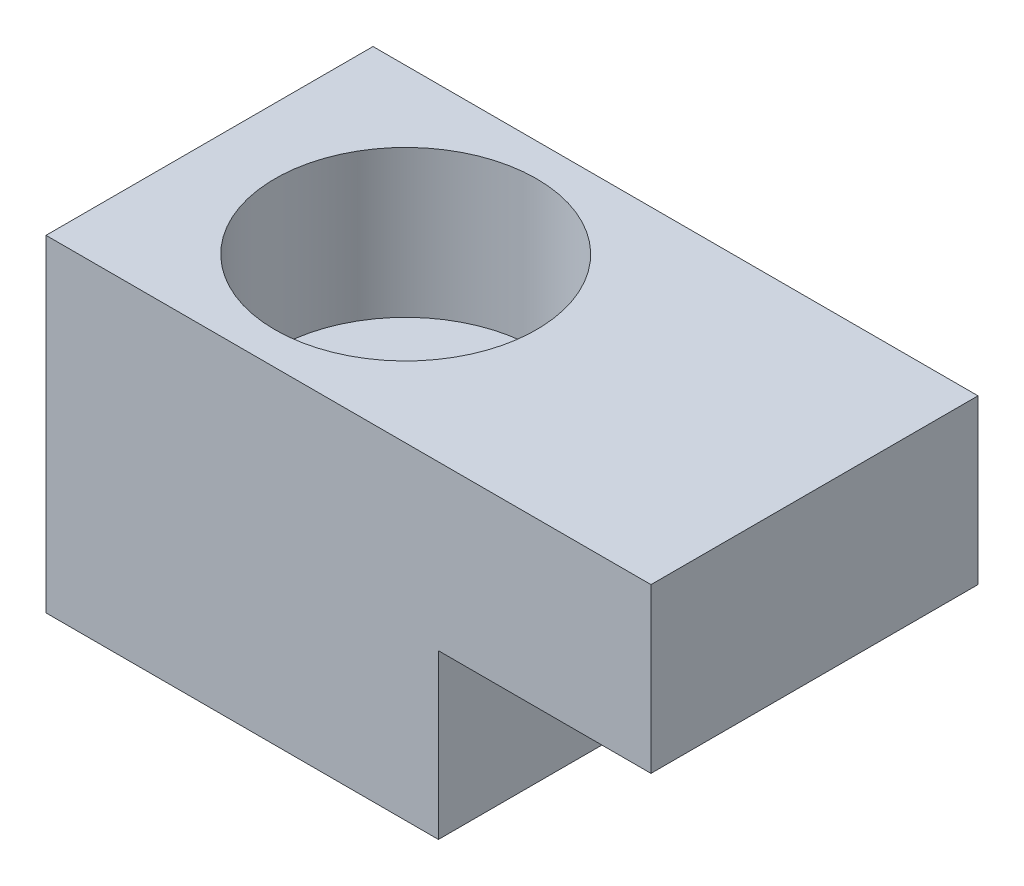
from build123d import *

# Parameters (mm, degrees)
EXTRUDE_1_DEPTH     = 10
SKETCH_2_R          = 2.25
CUT_EXTRUDE_1_DEPTH = 10
SKETCH_3_R          = 4
CUT_EXTRUDE_2_DEPTH = 4.5
SKETCH_5_R          = 2.1
CUT_EXTRUDE_3_DEPTH = 3


with BuildPart() as part:
    # Sketch 1 → Extrude 1 (new body)
    with BuildSketch(Plane.XY):
        Polygon((0, 0), (0, 10), (18.5, 10), (18.5, 5), (12, 5), (12, 0), align=None)
    extrude(amount=EXTRUDE_1_DEPTH)

    # Sketch 2 → Cut-Extrude 1 (cut)
    with BuildSketch(Plane(origin=(0, 10, 0), x_dir=(1, 0, 0), z_dir=(0, 1, 0))):
        with Locations(Location((6, -5, 0), (0, 0, 270))):
            Circle(SKETCH_2_R)
    extrude(amount=-CUT_EXTRUDE_1_DEPTH, mode=Mode.SUBTRACT)

    # Sketch 3 → Cut-Extrude 2 (cut)
    with BuildSketch(Plane(origin=(0, 10, 0), x_dir=(1, 0, 0), z_dir=(0, 1, 0))):
        with Locations(Location((6, -5, 0), (0, 0, 270))):
            Circle(SKETCH_3_R)
    extrude(amount=-CUT_EXTRUDE_2_DEPTH, mode=Mode.SUBTRACT)

    # Sketch 5 → Cut-Extrude 3 (cut)
    with BuildSketch(Plane.XZ.offset(-5)):
        with Locations(Location((15.25, 5, 0), (0, 0, 270))):
            Circle(SKETCH_5_R)
    extrude(amount=-CUT_EXTRUDE_3_DEPTH, mode=Mode.SUBTRACT)


solid = part.part
